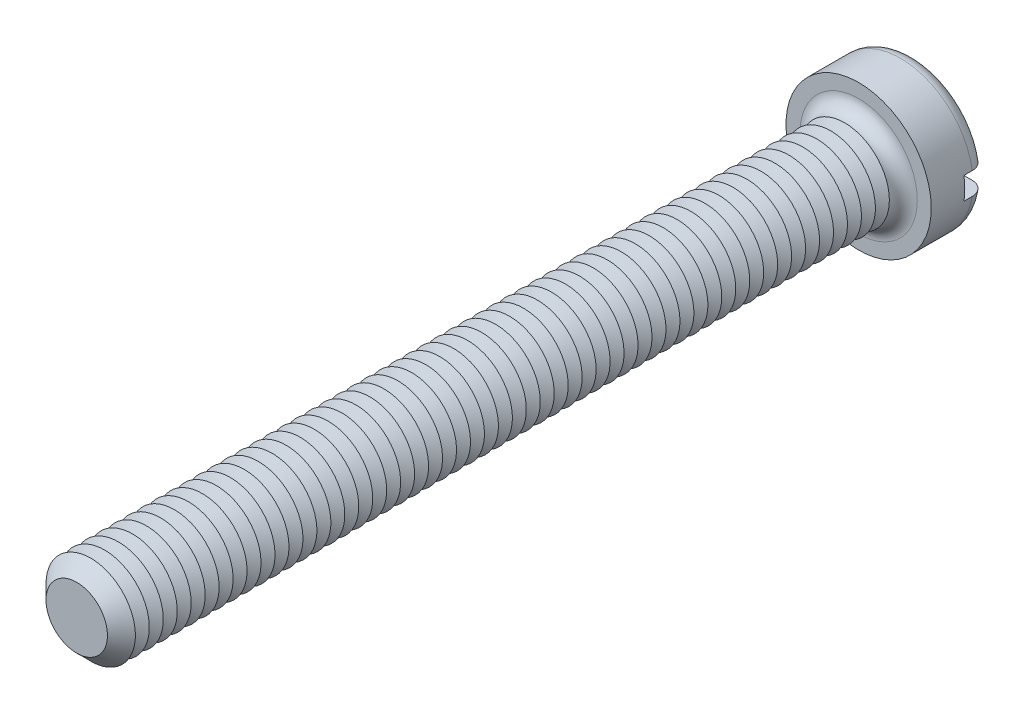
from build123d import *

# Parameters (mm, degrees)
SKETCH3_R           = 6.5
BOSS_EXTRUDE2_DEPTH = 5
SKETCH4_R           = 4
BOSS_EXTRUDE3_DEPTH = 70
FILLET1_R           = 1.25
CHAMFER1_SIZE       = 1.25
LPATTERN1_COUNT     = 54
LPATTERN1_PITCH     = 1.25
SKETCH8_W           = 13
SKETCH8_H           = 2
CUT_EXTRUDE1_DEPTH  = 2


with BuildPart() as part:
    # Sketch3 → Boss-Extrude2 (new body)
    with BuildSketch(Plane.XY):
        Circle(SKETCH3_R)
    extrude(amount=-BOSS_EXTRUDE2_DEPTH)

    # Sketch4 → Boss-Extrude3 (add)
    with BuildSketch(Plane.XY):
        Circle(SKETCH4_R)
    extrude(amount=BOSS_EXTRUDE3_DEPTH)

    # Fillet1
    fillet1_edges = [part.edges().sort_by_distance(p)[0] for p in [
        (-6.5, 0, -5),
        (-4, 0, 0),
    ]]
    fillet(fillet1_edges, radius=FILLET1_R)

    # Chamfer1
    chamfer1_edges = [part.edges().sort_by_distance(p)[0] for p in [
        (-4, 0, 70),
    ]]
    chamfer(chamfer1_edges, length=CHAMFER1_SIZE)

    # Sketch6 → Cut-Revolve1 (revolve, cut)
    with BuildSketch(Plane(origin=(0, 0, 0), x_dir=(0, 0, -1), z_dir=(1, 0, 0)), mode=Mode.PRIVATE) as cut_revolve1_sk:
        Polygon((-1.25, 4), (-1.875, 2.917468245), (-2.5, 4), align=None)
    cut_revolve1 = revolve(cut_revolve1_sk.sketch.rotate(Axis((0, 0, -1.694361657), (0, 0, 1)), 90), axis=Axis((0, 0, -1.694361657), (0, 0, 1)), mode=Mode.SUBTRACT)

    # LPattern1: Cut-Revolve1 ×54
    with Locations(*[(0, 0, i * LPATTERN1_PITCH) for i in range(1, LPATTERN1_COUNT)]):
        add(cut_revolve1, mode=Mode.SUBTRACT)

    # Sketch8 → Cut-Extrude1 (cut)
    with BuildSketch(Plane(origin=(0, 0, -5), x_dir=(-1, 0, 0), z_dir=(0, 0, -1))):
        Rectangle(SKETCH8_W, SKETCH8_H)
    extrude(amount=-CUT_EXTRUDE1_DEPTH, mode=Mode.SUBTRACT)


solid = part.part
